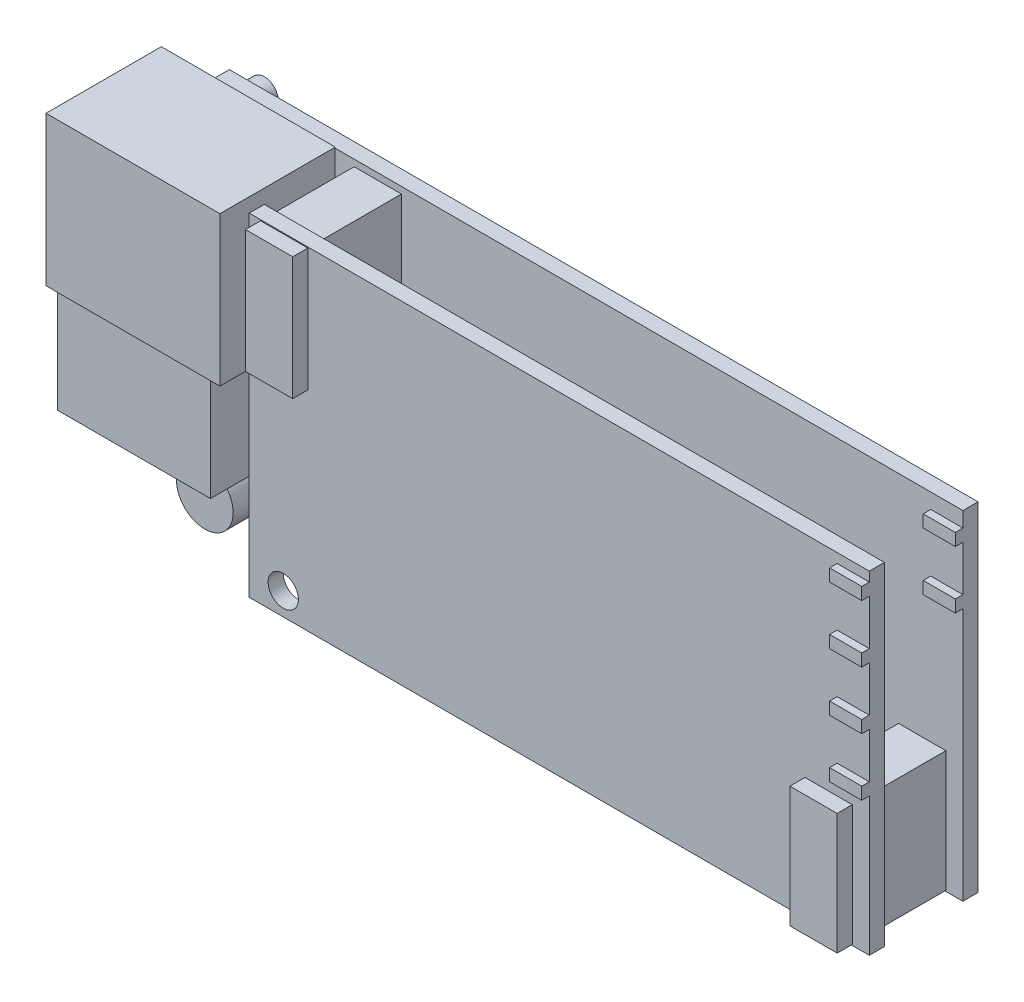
from build123d import *

# Parameters (mm, degrees)
SKETCH1_W            = 79.2
SKETCH1_H            = 35.8
BOSS_EXTRUDE1_DEPTH  = 1.6
SKETCH2_W            = 65.6
SKETCH2_H            = 35.2
BOSS_EXTRUDE2_DEPTH  = 1.6
SKETCH3_W            = 18.4
SKETCH3_H            = 15.8
BOSS_EXTRUDE3_DEPTH  = 12.2
SKETCH4_W            = 16.2
SKETCH4_H            = 12
BOSS_EXTRUDE4_DEPTH  = 10.8
SKETCH5_R            = 3
BOSS_EXTRUDE5_DEPTH  = 7
SKETCH6_W            = 5
SKETCH6_H            = 12.8
SKETCH6_H_2          = 13
BOSS_EXTRUDE6_DEPTH  = 1.6
SKETCH7_W            = 3.4
SKETCH7_H            = 1.3
BOSS_EXTRUDE7_DEPTH  = 0.8
SKETCH8_W            = 3.4
SKETCH8_H            = 1.3
BOSS_EXTRUDE8_DEPTH  = 0.8
SKETCH9_W            = 3.4
SKETCH9_H            = 6.2
BOSS_EXTRUDE9_DEPTH  = 1.8
SKETCH10_W           = 10
SKETCH10_H           = 10
BOSS_EXTRUDE10_DEPTH = 2.2
SKETCH11_W           = 13.8
SKETCH11_H           = 13.8
BOSS_EXTRUDE11_DEPTH = 1.6
SKETCH12_W           = 5
SKETCH12_H           = 12.8
SKETCH12_H_2         = 13
BOSS_EXTRUDE12_DEPTH = 8.3
SKETCH13_W           = 10.4
SKETCH13_H           = 21
BOSS_EXTRUDE13_DEPTH = 1
SKETCH14_W           = 1.5
SKETCH14_H           = 3.6
BOSS_EXTRUDE14_DEPTH = 1.4
SKETCH15_R           = 1.6
CUT_EXTRUDE1_DEPTH   = 14.4
SKETCH17_R           = 1.5
BOSS_EXTRUDE15_DEPTH = 1.7


with BuildPart() as part:
    # Sketch1 → Boss-Extrude1 (new body)
    with BuildSketch(Plane.XY):
        with Locations((6.369230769, -1.376923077)):
            Rectangle(SKETCH1_W, SKETCH1_H)
    extrude(amount=BOSS_EXTRUDE1_DEPTH)

    # Sketch3 → Boss-Extrude3 (add)
    with BuildSketch(Plane.XY.offset(1.6)):
        with Locations((-29.630769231, 8.723076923)):
            Rectangle(SKETCH3_W, SKETCH3_H)
    extrude(amount=BOSS_EXTRUDE3_DEPTH)

    # Sketch4 → Boss-Extrude4 (add)
    with BuildSketch(Plane.XY.offset(1.6)):
        with Locations((-30.930769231, -5.376923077)):
            Rectangle(SKETCH4_W, SKETCH4_H)
    extrude(amount=BOSS_EXTRUDE4_DEPTH)

    # Sketch5 → Boss-Extrude5 (add)
    with BuildSketch(Plane.XY.offset(1.6)):
        with Locations((-27.230769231, -15.276923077)):
            Circle(SKETCH5_R)
    extrude(amount=BOSS_EXTRUDE5_DEPTH)

    # Sketch8 → Boss-Extrude8 (add)
    with BuildSketch(Plane.XY.offset(1.6)):
        with Locations((44.269230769, 14.273076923)):
            Rectangle(SKETCH8_W, SKETCH8_H)
        with Locations((44.269230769, 8.173076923)):
            Rectangle(SKETCH8_W, SKETCH8_H)
    extrude(amount=BOSS_EXTRUDE8_DEPTH)

    # Sketch9 → Boss-Extrude9 (add)
    with BuildSketch(Plane(origin=(0, 0, 0), x_dir=(-1, 0, 0), z_dir=(0, 0, -1))):
        with Locations((3.930769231, 11.623076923)):
            Rectangle(SKETCH9_W, SKETCH9_H)
        with Locations((-9.869230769, 11.623076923)):
            Rectangle(SKETCH9_W, SKETCH9_H)
    extrude(amount=BOSS_EXTRUDE9_DEPTH)

    # Sketch10 → Boss-Extrude10 (add)
    with BuildSketch(Plane(origin=(0, 0, 0), x_dir=(-1, 0, 0), z_dir=(0, 0, -1))):
        with Locations((12.230769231, -4.776923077)):
            Rectangle(SKETCH10_W, SKETCH10_H)
    extrude(amount=BOSS_EXTRUDE10_DEPTH)

    # Sketch11 → Boss-Extrude11 (add)
    with BuildSketch(Plane(origin=(0, 0, 0), x_dir=(-1, 0, 0), z_dir=(0, 0, -1))):
        with Locations((-8.869230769, -1.676923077)):
            Rectangle(SKETCH11_W, SKETCH11_H)
    extrude(amount=BOSS_EXTRUDE11_DEPTH)



with BuildPart() as body_2:
    # Sketch2 → Boss-Extrude2 (new body)
    with BuildSketch(Plane.XY.offset(9.9)):
        with Locations((13.169230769, -1.676923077)):
            Rectangle(SKETCH2_W, SKETCH2_H)
    extrude(amount=BOSS_EXTRUDE2_DEPTH)

    # Sketch6 → Boss-Extrude6 (add)
    with BuildSketch(Plane.XY.offset(11.5)):
        with Locations((41.669230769, -12.776923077)):
            Rectangle(SKETCH6_W, SKETCH6_H)
        with Locations((-15.930769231, 9.323076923)):
            Rectangle(SKETCH6_W, SKETCH6_H_2)
    extrude(amount=BOSS_EXTRUDE6_DEPTH)

    # Sketch7 → Boss-Extrude7 (add)
    with BuildSketch(Plane.XY.offset(11.5)):
        with Locations((44.269230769, 14.273076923)):
            Rectangle(SKETCH7_W, SKETCH7_H)
        with Locations((44.269230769, 8.173076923)):
            Rectangle(SKETCH7_W, SKETCH7_H)
        with Locations((44.269230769, 2.073076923)):
            Rectangle(SKETCH7_W, SKETCH7_H)
        with Locations((44.269230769, -4.026923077)):
            Rectangle(SKETCH7_W, SKETCH7_H)
    extrude(amount=BOSS_EXTRUDE7_DEPTH)


with BuildPart() as part_1:
    add(part.part)

    add(body_2.part)  # Boss-Extrude12 merges body 2
    # Sketch12 → Boss-Extrude12 (add)
    with BuildSketch(Plane.XY.offset(1.6)):
        with Locations((41.669230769, -12.776923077)):
            Rectangle(SKETCH12_W, SKETCH12_H)
        with Locations((-15.930769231, 9.323076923)):
            Rectangle(SKETCH12_W, SKETCH12_H_2)
    extrude(amount=BOSS_EXTRUDE12_DEPTH)

    # Sketch13 → Boss-Extrude13 (add)
    with BuildSketch(Plane(origin=(0, 0, 0), x_dir=(-1, 0, 0), z_dir=(0, 0, -1))):
        with Locations((-28.769230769, -0.576923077)):
            Rectangle(SKETCH13_W, SKETCH13_H)
    extrude(amount=BOSS_EXTRUDE13_DEPTH)

    # Sketch14 → Boss-Extrude14 (add)
    with BuildSketch(Plane(origin=(0, 0, 0), x_dir=(-1, 0, 0), z_dir=(0, 0, -1))):
        with Locations((-38.719230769, -0.476923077)):
            Rectangle(SKETCH14_W, SKETCH14_H)
    extrude(amount=BOSS_EXTRUDE14_DEPTH)

    # Sketch15 → Cut-Extrude1 (cut)
    with BuildSketch(Plane.XY):
        with Locations((-16.030769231, -16.876923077)):
            Circle(SKETCH15_R)
    extrude(amount=CUT_EXTRUDE1_DEPTH, mode=Mode.SUBTRACT)

    # Sketch17 → Boss-Extrude15 (add)
    with BuildSketch(Plane.XY):
        with Locations((-31.230769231, 14.523076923)):
            Circle(SKETCH17_R)
    extrude(amount=-BOSS_EXTRUDE15_DEPTH)


solid = part_1.part
